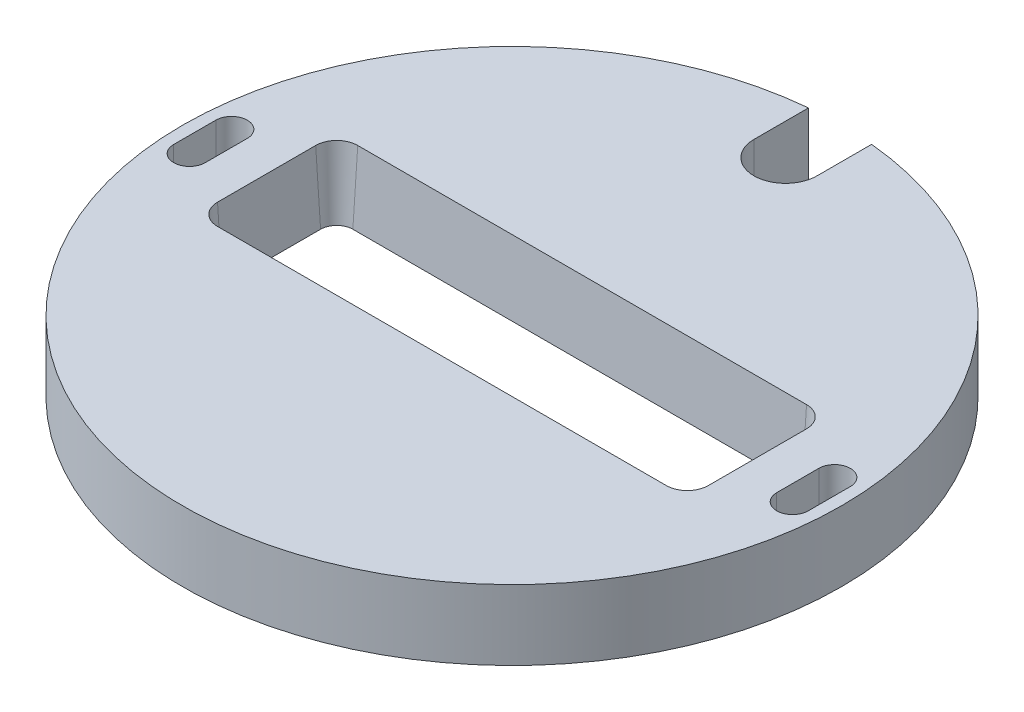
ISO-10303-21;
HEADER;
FILE_DESCRIPTION(('STEP AP214'),'2;1');
FILE_NAME('part.step','',(''),(''),'','','');
FILE_SCHEMA(('AUTOMOTIVE_DESIGN { 1 0 10303 214 1 1 1 1 }'));
ENDSEC;
DATA;
#1=APPLICATION_CONTEXT('core data for automotive mechanical design processes');
#2=APPLICATION_PROTOCOL_DEFINITION('international standard','automotive_design',2000,#1);
#3=PRODUCT_CONTEXT('',#1,'mechanical');
#4=PRODUCT('Part','Part','',(#3));
#5=PRODUCT_RELATED_PRODUCT_CATEGORY('part','',(#4));
#6=PRODUCT_DEFINITION_FORMATION('','',#4);
#7=PRODUCT_DEFINITION_CONTEXT('part definition',#1,'design');
#8=PRODUCT_DEFINITION('design','',#6,#7);
#9=PRODUCT_DEFINITION_SHAPE('','',#8);
#10=(LENGTH_UNIT() NAMED_UNIT(*) SI_UNIT(.MILLI.,.METRE.));
#11=(NAMED_UNIT(*) PLANE_ANGLE_UNIT() SI_UNIT($,.RADIAN.));
#12=(NAMED_UNIT(*) SI_UNIT($,.STERADIAN.) SOLID_ANGLE_UNIT());
#13=UNCERTAINTY_MEASURE_WITH_UNIT(LENGTH_MEASURE(1.E-05),#10,'distance_accuracy_value','');
#14=(GEOMETRIC_REPRESENTATION_CONTEXT(3) GLOBAL_UNCERTAINTY_ASSIGNED_CONTEXT((#13)) GLOBAL_UNIT_ASSIGNED_CONTEXT((#10,
#11,#12)) REPRESENTATION_CONTEXT('',''));
#15=CARTESIAN_POINT('',(0.,0.,0.));
#16=DIRECTION('',(0.,0.,1.));
#17=DIRECTION('',(1.,0.,0.));
#18=AXIS2_PLACEMENT_3D('',#15,#16,#17);
#19=CARTESIAN_POINT('',(0.,10.,0.));
#20=DIRECTION('',(0.,1.,0.));
#21=DIRECTION('',(0.,0.,1.));
#22=AXIS2_PLACEMENT_3D('',#19,#20,#21);
#23=PLANE('',#22);
#24=DIRECTION('',(0.,0.,1.));
#25=VECTOR('',#24,1.);
#26=CARTESIAN_POINT('',(4.5,10.,-39.));
#27=LINE('',#26,#25);
#28=CARTESIAN_POINT('',(4.5,10.,-39.));
#29=VERTEX_POINT('',#28);
#30=CARTESIAN_POINT('',(4.5,10.,-46.7840784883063));
#31=VERTEX_POINT('',#30);
#32=EDGE_CURVE('E239',#29,#31,#27,.F.);
#33=ORIENTED_EDGE('',*,*,#32,.F.);
#34=CARTESIAN_POINT('',(0.,10.,-39.));
#35=DIRECTION('',(0.,-1.,0.));
#36=DIRECTION('',(0.,0.,-1.));
#37=AXIS2_PLACEMENT_3D('',#34,#35,#36);
#38=CIRCLE('',#37,4.5);
#39=CARTESIAN_POINT('',(-4.5,10.,-39.));
#40=VERTEX_POINT('',#39);
#41=EDGE_CURVE('E234',#29,#40,#38,.T.);
#42=ORIENTED_EDGE('',*,*,#41,.T.);
#43=DIRECTION('',(0.,0.,1.));
#44=VECTOR('',#43,1.);
#45=CARTESIAN_POINT('',(-4.5,10.,-39.));
#46=LINE('',#45,#44);
#47=CARTESIAN_POINT('',(-4.5,10.,-46.7840784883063));
#48=VERTEX_POINT('',#47);
#49=EDGE_CURVE('E267',#40,#48,#46,.F.);
#50=ORIENTED_EDGE('',*,*,#49,.T.);
#51=CARTESIAN_POINT('',(0.,10.,0.));
#52=DIRECTION('',(0.,-1.,0.));
#53=DIRECTION('',(0.,0.,-1.));
#54=AXIS2_PLACEMENT_3D('',#51,#52,#53);
#55=CIRCLE('',#54,47.);
#56=EDGE_CURVE('E237',#31,#48,#55,.T.);
#57=ORIENTED_EDGE('',*,*,#56,.F.);
#58=EDGE_LOOP('',(#33,#42,#50,#57));
#59=FACE_BOUND('',#58,.T.);
#60=CARTESIAN_POINT('',(-43.,10.,3.));
#61=DIRECTION('',(0.,1.,0.));
#62=DIRECTION('',(0.,0.,1.));
#63=AXIS2_PLACEMENT_3D('',#60,#61,#62);
#64=CIRCLE('',#63,2.25);
#65=CARTESIAN_POINT('',(-40.75,10.,3.));
#66=VERTEX_POINT('',#65);
#67=CARTESIAN_POINT('',(-45.25,10.,3.));
#68=VERTEX_POINT('',#67);
#69=EDGE_CURVE('E245',#66,#68,#64,.F.);
#70=ORIENTED_EDGE('',*,*,#69,.T.);
#71=DIRECTION('',(0.,0.,1.));
#72=VECTOR('',#71,1.);
#73=CARTESIAN_POINT('',(-45.25,10.,-3.));
#74=LINE('',#73,#72);
#75=CARTESIAN_POINT('',(-45.25,10.,-3.));
#76=VERTEX_POINT('',#75);
#77=EDGE_CURVE('E275',#68,#76,#74,.F.);
#78=ORIENTED_EDGE('',*,*,#77,.T.);
#79=CARTESIAN_POINT('',(-43.,10.,-3.));
#80=DIRECTION('',(0.,1.,0.));
#81=DIRECTION('',(0.,0.,1.));
#82=AXIS2_PLACEMENT_3D('',#79,#80,#81);
#83=CIRCLE('',#82,2.25);
#84=CARTESIAN_POINT('',(-40.75,10.,-3.));
#85=VERTEX_POINT('',#84);
#86=EDGE_CURVE('E241',#76,#85,#83,.F.);
#87=ORIENTED_EDGE('',*,*,#86,.T.);
#88=DIRECTION('',(0.,0.,-1.));
#89=VECTOR('',#88,1.);
#90=CARTESIAN_POINT('',(-40.75,10.,-3.));
#91=LINE('',#90,#89);
#92=EDGE_CURVE('E240',#85,#66,#91,.F.);
#93=ORIENTED_EDGE('',*,*,#92,.T.);
#94=EDGE_LOOP('',(#70,#78,#87,#93));
#95=FACE_BOUND('',#94,.T.);
#96=DIRECTION('',(0.,0.,-1.));
#97=VECTOR('',#96,1.);
#98=CARTESIAN_POINT('',(45.25,10.,3.));
#99=LINE('',#98,#97);
#100=CARTESIAN_POINT('',(45.25,10.,-3.));
#101=VERTEX_POINT('',#100);
#102=CARTESIAN_POINT('',(45.25,10.,3.));
#103=VERTEX_POINT('',#102);
#104=EDGE_CURVE('E186',#101,#103,#99,.F.);
#105=ORIENTED_EDGE('',*,*,#104,.T.);
#106=CARTESIAN_POINT('',(43.,10.,3.));
#107=DIRECTION('',(0.,1.,0.));
#108=DIRECTION('',(0.,0.,1.));
#109=AXIS2_PLACEMENT_3D('',#106,#107,#108);
#110=CIRCLE('',#109,2.25);
#111=CARTESIAN_POINT('',(40.75,10.,3.));
#112=VERTEX_POINT('',#111);
#113=EDGE_CURVE('E249',#103,#112,#110,.F.);
#114=ORIENTED_EDGE('',*,*,#113,.T.);
#115=DIRECTION('',(0.,0.,1.));
#116=VECTOR('',#115,1.);
#117=CARTESIAN_POINT('',(40.75,10.,3.));
#118=LINE('',#117,#116);
#119=CARTESIAN_POINT('',(40.75,10.,-3.));
#120=VERTEX_POINT('',#119);
#121=EDGE_CURVE('E248',#112,#120,#118,.F.);
#122=ORIENTED_EDGE('',*,*,#121,.T.);
#123=CARTESIAN_POINT('',(43.,10.,-3.));
#124=DIRECTION('',(0.,1.,0.));
#125=DIRECTION('',(0.,0.,1.));
#126=AXIS2_PLACEMENT_3D('',#123,#124,#125);
#127=CIRCLE('',#126,2.25);
#128=EDGE_CURVE('E179',#120,#101,#127,.F.);
#129=ORIENTED_EDGE('',*,*,#128,.T.);
#130=EDGE_LOOP('',(#105,#114,#122,#129));
#131=FACE_BOUND('',#130,.T.);
#132=CARTESIAN_POINT('',(-32.,9.99999999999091,-7.));
#133=DIRECTION('',(0.,1.,0.));
#134=DIRECTION('',(0.,0.,1.));
#135=AXIS2_PLACEMENT_3D('',#132,#133,#134);
#136=CIRCLE('',#135,2.99999999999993);
#137=CARTESIAN_POINT('',(-35.000000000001,9.99999999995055,-6.99999999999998));
#138=VERTEX_POINT('',#137);
#139=CARTESIAN_POINT('',(-32.,9.99999999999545,-9.99999999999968));
#140=VERTEX_POINT('',#139);
#141=EDGE_CURVE('E254',#138,#140,#136,.F.);
#142=ORIENTED_EDGE('',*,*,#141,.T.);
#143=DIRECTION('',(1.,0.,0.));
#144=VECTOR('',#143,1.);
#145=CARTESIAN_POINT('',(-32.,10.,-10.));
#146=LINE('',#145,#144);
#147=CARTESIAN_POINT('',(32.,9.99999999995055,-9.999999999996));
#148=VERTEX_POINT('',#147);
#149=EDGE_CURVE('E188',#140,#148,#146,.T.);
#150=ORIENTED_EDGE('',*,*,#149,.T.);
#151=CARTESIAN_POINT('',(32.,9.99999999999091,-7.));
#152=DIRECTION('',(0.,1.,0.));
#153=DIRECTION('',(0.,0.,1.));
#154=AXIS2_PLACEMENT_3D('',#151,#152,#153);
#155=CIRCLE('',#154,2.99999999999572);
#156=CARTESIAN_POINT('',(34.9999999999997,9.99999999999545,-6.99999999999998));
#157=VERTEX_POINT('',#156);
#158=EDGE_CURVE('E176',#148,#157,#155,.F.);
#159=ORIENTED_EDGE('',*,*,#158,.T.);
#160=DIRECTION('',(0.,0.,1.));
#161=VECTOR('',#160,1.);
#162=CARTESIAN_POINT('',(35.,10.,-6.99999999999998));
#163=LINE('',#162,#161);
#164=CARTESIAN_POINT('',(34.9999999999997,9.99999999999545,6.99999999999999));
#165=VERTEX_POINT('',#164);
#166=EDGE_CURVE('E171',#157,#165,#163,.T.);
#167=ORIENTED_EDGE('',*,*,#166,.T.);
#168=CARTESIAN_POINT('',(32.,9.99999999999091,7.));
#169=DIRECTION('',(0.,1.,0.));
#170=DIRECTION('',(0.,0.,1.));
#171=AXIS2_PLACEMENT_3D('',#168,#169,#170);
#172=CIRCLE('',#171,2.99999999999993);
#173=CARTESIAN_POINT('',(32.,9.99999999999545,9.99999999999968));
#174=VERTEX_POINT('',#173);
#175=EDGE_CURVE('E27',#165,#174,#172,.F.);
#176=ORIENTED_EDGE('',*,*,#175,.T.);
#177=DIRECTION('',(1.,0.,0.));
#178=VECTOR('',#177,1.);
#179=CARTESIAN_POINT('',(-32.,10.,10.));
#180=LINE('',#179,#178);
#181=CARTESIAN_POINT('',(-32.,9.99999999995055,10.0000000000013));
#182=VERTEX_POINT('',#181);
#183=EDGE_CURVE('E196',#174,#182,#180,.F.);
#184=ORIENTED_EDGE('',*,*,#183,.T.);
#185=CARTESIAN_POINT('',(-32.,9.99999999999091,7.));
#186=DIRECTION('',(0.,1.,0.));
#187=DIRECTION('',(0.,0.,1.));
#188=AXIS2_PLACEMENT_3D('',#185,#186,#187);
#189=CIRCLE('',#188,2.99999999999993);
#190=CARTESIAN_POINT('',(-34.9999999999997,9.99999999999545,6.99999999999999));
#191=VERTEX_POINT('',#190);
#192=EDGE_CURVE('E255',#182,#191,#189,.F.);
#193=ORIENTED_EDGE('',*,*,#192,.T.);
#194=DIRECTION('',(0.,0.,1.));
#195=VECTOR('',#194,1.);
#196=CARTESIAN_POINT('',(-35.,10.,-6.99999999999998));
#197=LINE('',#196,#195);
#198=EDGE_CURVE('E192',#191,#138,#197,.F.);
#199=ORIENTED_EDGE('',*,*,#198,.T.);
#200=EDGE_LOOP('',(#142,#150,#159,#167,#176,#184,#193,#199));
#201=FACE_BOUND('',#200,.T.);
#202=ADVANCED_FACE('F24',(#59,#95,#131,#201),#23,.T.);
#203=CARTESIAN_POINT('',(32.,9.99999999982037,7.));
#204=DIRECTION('',(0.,1.,0.));
#205=DIRECTION('',(0.,0.,1.));
#206=AXIS2_PLACEMENT_3D('',#203,#204,#205);
#207=CONICAL_SURFACE('',#206,2.99999999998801,0.0698131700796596);
#208=DIRECTION('',(0.0697564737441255,0.997564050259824,0.));
#209=VECTOR('',#208,1.);
#210=CARTESIAN_POINT('',(35.,10.,6.99999999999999));
#211=LINE('',#210,#209);
#212=CARTESIAN_POINT('',(34.3007318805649,0.,6.99999999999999));
#213=VERTEX_POINT('',#212);
#214=EDGE_CURVE('E162',#165,#213,#211,.F.);
#215=ORIENTED_EDGE('',*,*,#214,.T.);
#216=CARTESIAN_POINT('',(32.,0.,7.));
#217=DIRECTION('',(0.,1.,0.));
#218=DIRECTION('',(0.,0.,1.));
#219=AXIS2_PLACEMENT_3D('',#216,#217,#218);
#220=CIRCLE('',#219,2.3007318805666);
#221=CARTESIAN_POINT('',(32.,0.,9.30073188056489));
#222=VERTEX_POINT('',#221);
#223=EDGE_CURVE('E231',#213,#222,#220,.F.);
#224=ORIENTED_EDGE('',*,*,#223,.T.);
#225=DIRECTION('',(0.,-0.997564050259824,-0.0697564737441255));
#226=VECTOR('',#225,1.);
#227=CARTESIAN_POINT('',(32.,10.,10.));
#228=LINE('',#227,#226);
#229=EDGE_CURVE('E164',#222,#174,#228,.F.);
#230=ORIENTED_EDGE('',*,*,#229,.T.);
#231=ORIENTED_EDGE('',*,*,#175,.F.);
#232=EDGE_LOOP('',(#215,#224,#230,#231));
#233=FACE_BOUND('',#232,.T.);
#234=ADVANCED_FACE('F160',(#233),#207,.F.);
#235=CARTESIAN_POINT('',(-32.,10.,10.));
#236=DIRECTION('',(0.,-0.0697564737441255,0.997564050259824));
#237=DIRECTION('',(0.,-0.997564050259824,-0.0697564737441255));
#238=AXIS2_PLACEMENT_3D('',#235,#236,#237);
#239=PLANE('',#238);
#240=ORIENTED_EDGE('',*,*,#229,.F.);
#241=DIRECTION('',(1.,0.,0.));
#242=VECTOR('',#241,1.);
#243=CARTESIAN_POINT('',(0.,0.,9.30073188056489));
#244=LINE('',#243,#242);
#245=CARTESIAN_POINT('',(-32.,1.4210854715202E-11,9.30073188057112));
#246=VERTEX_POINT('',#245);
#247=EDGE_CURVE('E230',#222,#246,#244,.F.);
#248=ORIENTED_EDGE('',*,*,#247,.T.);
#249=DIRECTION('',(0.,-0.997564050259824,-0.0697564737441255));
#250=VECTOR('',#249,1.);
#251=CARTESIAN_POINT('',(-31.9999999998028,499000.,34902.7798916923));
#252=LINE('',#251,#250);
#253=EDGE_CURVE('E198',#246,#182,#252,.F.);
#254=ORIENTED_EDGE('',*,*,#253,.T.);
#255=ORIENTED_EDGE('',*,*,#183,.F.);
#256=EDGE_LOOP('',(#240,#248,#254,#255));
#257=FACE_BOUND('',#256,.T.);
#258=ADVANCED_FACE('F529',(#257),#239,.F.);
#259=CARTESIAN_POINT('',(-32.,9.99999999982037,7.));
#260=DIRECTION('',(0.,1.,0.));
#261=DIRECTION('',(0.,0.,1.));
#262=AXIS2_PLACEMENT_3D('',#259,#260,#261);
#263=CONICAL_SURFACE('',#262,2.99999999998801,0.0698131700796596);
#264=ORIENTED_EDGE('',*,*,#253,.F.);
#265=CARTESIAN_POINT('',(-32.,0.,7.));
#266=DIRECTION('',(0.,1.,0.));
#267=DIRECTION('',(0.,0.,1.));
#268=AXIS2_PLACEMENT_3D('',#265,#266,#267);
#269=CIRCLE('',#268,2.3007318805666);
#270=CARTESIAN_POINT('',(-34.3007318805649,0.,7.));
#271=VERTEX_POINT('',#270);
#272=EDGE_CURVE('E227',#246,#271,#269,.F.);
#273=ORIENTED_EDGE('',*,*,#272,.T.);
#274=DIRECTION('',(0.0697564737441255,-0.997564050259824,0.));
#275=VECTOR('',#274,1.);
#276=CARTESIAN_POINT('',(-35.,10.,6.99999999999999));
#277=LINE('',#276,#275);
#278=EDGE_CURVE('E195',#271,#191,#277,.F.);
#279=ORIENTED_EDGE('',*,*,#278,.T.);
#280=ORIENTED_EDGE('',*,*,#192,.F.);
#281=EDGE_LOOP('',(#264,#273,#279,#280));
#282=FACE_BOUND('',#281,.T.);
#283=ADVANCED_FACE('F521',(#282),#263,.F.);
#284=CARTESIAN_POINT('',(-35.,10.,-6.99999999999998));
#285=DIRECTION('',(-0.997564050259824,-0.0697564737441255,0.));
#286=DIRECTION('',(0.0697564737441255,-0.997564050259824,0.));
#287=AXIS2_PLACEMENT_3D('',#284,#285,#286);
#288=PLANE('',#287);
#289=ORIENTED_EDGE('',*,*,#278,.F.);
#290=DIRECTION('',(0.,0.,1.));
#291=VECTOR('',#290,1.);
#292=CARTESIAN_POINT('',(-34.3007318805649,0.,0.));
#293=LINE('',#292,#291);
#294=CARTESIAN_POINT('',(-34.3007318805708,1.4210854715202E-11,-6.99999999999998));
#295=VERTEX_POINT('',#294);
#296=EDGE_CURVE('E226',#271,#295,#293,.F.);
#297=ORIENTED_EDGE('',*,*,#296,.T.);
#298=DIRECTION('',(0.0697564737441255,-0.997564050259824,0.));
#299=VECTOR('',#298,1.);
#300=CARTESIAN_POINT('',(-34927.7798916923,499000.,-6.99999999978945));
#301=LINE('',#300,#299);
#302=EDGE_CURVE('E194',#295,#138,#301,.F.);
#303=ORIENTED_EDGE('',*,*,#302,.T.);
#304=ORIENTED_EDGE('',*,*,#198,.F.);
#305=EDGE_LOOP('',(#289,#297,#303,#304));
#306=FACE_BOUND('',#305,.T.);
#307=ADVANCED_FACE('F299',(#306),#288,.F.);
#308=CARTESIAN_POINT('',(-32.,9.99999999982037,-7.));
#309=DIRECTION('',(0.,1.,0.));
#310=DIRECTION('',(0.,0.,1.));
#311=AXIS2_PLACEMENT_3D('',#308,#309,#310);
#312=CONICAL_SURFACE('',#311,2.99999999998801,0.0698131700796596);
#313=ORIENTED_EDGE('',*,*,#302,.F.);
#314=CARTESIAN_POINT('',(-32.,0.,-7.));
#315=DIRECTION('',(0.,1.,0.));
#316=DIRECTION('',(0.,0.,1.));
#317=AXIS2_PLACEMENT_3D('',#314,#315,#316);
#318=CIRCLE('',#317,2.3007318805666);
#319=CARTESIAN_POINT('',(-32.,0.,-9.30073188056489));
#320=VERTEX_POINT('',#319);
#321=EDGE_CURVE('E223',#295,#320,#318,.F.);
#322=ORIENTED_EDGE('',*,*,#321,.T.);
#323=DIRECTION('',(0.,0.997564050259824,-0.0697564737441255));
#324=VECTOR('',#323,1.);
#325=CARTESIAN_POINT('',(-32.,10.,-10.));
#326=LINE('',#325,#324);
#327=EDGE_CURVE('E191',#320,#140,#326,.T.);
#328=ORIENTED_EDGE('',*,*,#327,.T.);
#329=ORIENTED_EDGE('',*,*,#141,.F.);
#330=EDGE_LOOP('',(#313,#322,#328,#329));
#331=FACE_BOUND('',#330,.T.);
#332=ADVANCED_FACE('F304',(#331),#312,.F.);
#333=CARTESIAN_POINT('',(-32.,10.,-10.));
#334=DIRECTION('',(0.,-0.0697564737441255,-0.997564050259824));
#335=DIRECTION('',(0.,0.997564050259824,-0.0697564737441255));
#336=AXIS2_PLACEMENT_3D('',#333,#334,#335);
#337=PLANE('',#336);
#338=ORIENTED_EDGE('',*,*,#327,.F.);
#339=DIRECTION('',(1.,0.,0.));
#340=VECTOR('',#339,1.);
#341=CARTESIAN_POINT('',(0.,0.,-9.30073188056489));
#342=LINE('',#341,#340);
#343=CARTESIAN_POINT('',(32.,1.4210854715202E-11,-9.30073188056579));
#344=VERTEX_POINT('',#343);
#345=EDGE_CURVE('E222',#320,#344,#342,.T.);
#346=ORIENTED_EDGE('',*,*,#345,.T.);
#347=DIRECTION('',(0.,-0.997564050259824,0.0697564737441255));
#348=VECTOR('',#347,1.);
#349=CARTESIAN_POINT('',(32.,499000.,-34902.7798916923));
#350=LINE('',#349,#348);
#351=EDGE_CURVE('E190',#344,#148,#350,.F.);
#352=ORIENTED_EDGE('',*,*,#351,.T.);
#353=ORIENTED_EDGE('',*,*,#149,.F.);
#354=EDGE_LOOP('',(#338,#346,#352,#353));
#355=FACE_BOUND('',#354,.T.);
#356=ADVANCED_FACE('F498',(#355),#337,.F.);
#357=CARTESIAN_POINT('',(32.,9.99999999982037,-7.));
#358=DIRECTION('',(0.,1.,0.));
#359=DIRECTION('',(0.,0.,1.));
#360=AXIS2_PLACEMENT_3D('',#357,#358,#359);
#361=CONICAL_SURFACE('',#360,2.9999999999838,0.0698131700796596);
#362=ORIENTED_EDGE('',*,*,#351,.F.);
#363=CARTESIAN_POINT('',(32.,0.,-7.));
#364=DIRECTION('',(0.,1.,0.));
#365=DIRECTION('',(0.,0.,1.));
#366=AXIS2_PLACEMENT_3D('',#363,#364,#365);
#367=CIRCLE('',#366,2.3007318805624);
#368=CARTESIAN_POINT('',(34.3007318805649,0.,-6.99999999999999));
#369=VERTEX_POINT('',#368);
#370=EDGE_CURVE('E219',#344,#369,#367,.F.);
#371=ORIENTED_EDGE('',*,*,#370,.T.);
#372=DIRECTION('',(0.0697564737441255,0.997564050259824,0.));
#373=VECTOR('',#372,1.);
#374=CARTESIAN_POINT('',(35.,10.,-6.99999999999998));
#375=LINE('',#374,#373);
#376=EDGE_CURVE('E175',#369,#157,#375,.T.);
#377=ORIENTED_EDGE('',*,*,#376,.T.);
#378=ORIENTED_EDGE('',*,*,#158,.F.);
#379=EDGE_LOOP('',(#362,#371,#377,#378));
#380=FACE_BOUND('',#379,.T.);
#381=ADVANCED_FACE('F490',(#380),#361,.F.);
#382=CARTESIAN_POINT('',(35.,10.,-6.99999999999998));
#383=DIRECTION('',(0.997564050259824,-0.0697564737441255,0.));
#384=DIRECTION('',(0.0697564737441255,0.997564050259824,0.));
#385=AXIS2_PLACEMENT_3D('',#382,#383,#384);
#386=PLANE('',#385);
#387=ORIENTED_EDGE('',*,*,#376,.F.);
#388=DIRECTION('',(0.,0.,1.));
#389=VECTOR('',#388,1.);
#390=CARTESIAN_POINT('',(34.3007318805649,0.,0.));
#391=LINE('',#390,#389);
#392=EDGE_CURVE('E174',#369,#213,#391,.T.);
#393=ORIENTED_EDGE('',*,*,#392,.T.);
#394=ORIENTED_EDGE('',*,*,#214,.F.);
#395=ORIENTED_EDGE('',*,*,#166,.F.);
#396=EDGE_LOOP('',(#387,#393,#394,#395));
#397=FACE_BOUND('',#396,.T.);
#398=ADVANCED_FACE('F170',(#397),#386,.F.);
#399=CARTESIAN_POINT('',(43.,0.,-3.));
#400=DIRECTION('',(0.,1.,0.));
#401=DIRECTION('',(0.,0.,1.));
#402=AXIS2_PLACEMENT_3D('',#399,#400,#401);
#403=CYLINDRICAL_SURFACE('',#402,2.25);
#404=DIRECTION('',(0.,1.,0.));
#405=VECTOR('',#404,1.);
#406=CARTESIAN_POINT('',(40.75,0.,-3.));
#407=LINE('',#406,#405);
#408=CARTESIAN_POINT('',(40.75,0.,-3.));
#409=VERTEX_POINT('',#408);
#410=EDGE_CURVE('E250',#120,#409,#407,.F.);
#411=ORIENTED_EDGE('',*,*,#410,.T.);
#412=CARTESIAN_POINT('',(43.,0.,-3.));
#413=DIRECTION('',(0.,1.,0.));
#414=DIRECTION('',(0.,0.,1.));
#415=AXIS2_PLACEMENT_3D('',#412,#413,#414);
#416=CIRCLE('',#415,2.25);
#417=CARTESIAN_POINT('',(45.25,0.,-3.));
#418=VERTEX_POINT('',#417);
#419=EDGE_CURVE('E216',#409,#418,#416,.F.);
#420=ORIENTED_EDGE('',*,*,#419,.T.);
#421=DIRECTION('',(0.,1.,0.));
#422=VECTOR('',#421,1.);
#423=CARTESIAN_POINT('',(45.25,0.,-3.));
#424=LINE('',#423,#422);
#425=EDGE_CURVE('E181',#418,#101,#424,.T.);
#426=ORIENTED_EDGE('',*,*,#425,.T.);
#427=ORIENTED_EDGE('',*,*,#128,.F.);
#428=EDGE_LOOP('',(#411,#420,#426,#427));
#429=FACE_BOUND('',#428,.T.);
#430=ADVANCED_FACE('F358',(#429),#403,.F.);
#431=CARTESIAN_POINT('',(45.25,0.,3.));
#432=DIRECTION('',(1.,0.,0.));
#433=DIRECTION('',(0.,0.,-1.));
#434=AXIS2_PLACEMENT_3D('',#431,#432,#433);
#435=PLANE('',#434);
#436=ORIENTED_EDGE('',*,*,#425,.F.);
#437=DIRECTION('',(0.,0.,1.));
#438=VECTOR('',#437,1.);
#439=CARTESIAN_POINT('',(45.25,0.,0.));
#440=LINE('',#439,#438);
#441=CARTESIAN_POINT('',(45.25,0.,3.));
#442=VERTEX_POINT('',#441);
#443=EDGE_CURVE('E215',#418,#442,#440,.T.);
#444=ORIENTED_EDGE('',*,*,#443,.T.);
#445=DIRECTION('',(0.,1.,0.));
#446=VECTOR('',#445,1.);
#447=CARTESIAN_POINT('',(45.25,0.,3.));
#448=LINE('',#447,#446);
#449=EDGE_CURVE('E251',#442,#103,#448,.T.);
#450=ORIENTED_EDGE('',*,*,#449,.T.);
#451=ORIENTED_EDGE('',*,*,#104,.F.);
#452=EDGE_LOOP('',(#436,#444,#450,#451));
#453=FACE_BOUND('',#452,.T.);
#454=ADVANCED_FACE('F353',(#453),#435,.F.);
#455=CARTESIAN_POINT('',(43.,0.,3.));
#456=DIRECTION('',(0.,1.,0.));
#457=DIRECTION('',(0.,0.,1.));
#458=AXIS2_PLACEMENT_3D('',#455,#456,#457);
#459=CYLINDRICAL_SURFACE('',#458,2.25);
#460=CARTESIAN_POINT('',(43.,0.,3.));
#461=DIRECTION('',(0.,1.,0.));
#462=DIRECTION('',(0.,0.,1.));
#463=AXIS2_PLACEMENT_3D('',#460,#461,#462);
#464=CIRCLE('',#463,2.25);
#465=CARTESIAN_POINT('',(40.75,0.,3.));
#466=VERTEX_POINT('',#465);
#467=EDGE_CURVE('E213',#442,#466,#464,.F.);
#468=ORIENTED_EDGE('',*,*,#467,.T.);
#469=DIRECTION('',(0.,1.,0.));
#470=VECTOR('',#469,1.);
#471=CARTESIAN_POINT('',(40.75,0.,3.));
#472=LINE('',#471,#470);
#473=EDGE_CURVE('E277',#466,#112,#472,.T.);
#474=ORIENTED_EDGE('',*,*,#473,.T.);
#475=ORIENTED_EDGE('',*,*,#113,.F.);
#476=ORIENTED_EDGE('',*,*,#449,.F.);
#477=EDGE_LOOP('',(#468,#474,#475,#476));
#478=FACE_BOUND('',#477,.T.);
#479=ADVANCED_FACE('F364',(#478),#459,.F.);
#480=CARTESIAN_POINT('',(40.75,0.,3.));
#481=DIRECTION('',(-1.,0.,0.));
#482=DIRECTION('',(0.,0.,1.));
#483=AXIS2_PLACEMENT_3D('',#480,#481,#482);
#484=PLANE('',#483);
#485=ORIENTED_EDGE('',*,*,#473,.F.);
#486=DIRECTION('',(0.,0.,1.));
#487=VECTOR('',#486,1.);
#488=CARTESIAN_POINT('',(40.75,0.,0.));
#489=LINE('',#488,#487);
#490=EDGE_CURVE('E212',#466,#409,#489,.F.);
#491=ORIENTED_EDGE('',*,*,#490,.T.);
#492=ORIENTED_EDGE('',*,*,#410,.F.);
#493=ORIENTED_EDGE('',*,*,#121,.F.);
#494=EDGE_LOOP('',(#485,#491,#492,#493));
#495=FACE_BOUND('',#494,.T.);
#496=ADVANCED_FACE('F361',(#495),#484,.F.);
#497=CARTESIAN_POINT('',(-43.,0.,3.));
#498=DIRECTION('',(0.,1.,0.));
#499=DIRECTION('',(0.,0.,1.));
#500=AXIS2_PLACEMENT_3D('',#497,#498,#499);
#501=CYLINDRICAL_SURFACE('',#500,2.25);
#502=CARTESIAN_POINT('',(-43.,0.,3.));
#503=DIRECTION('',(0.,1.,0.));
#504=DIRECTION('',(0.,0.,1.));
#505=AXIS2_PLACEMENT_3D('',#502,#503,#504);
#506=CIRCLE('',#505,2.25);
#507=CARTESIAN_POINT('',(-40.75,0.,3.));
#508=VERTEX_POINT('',#507);
#509=CARTESIAN_POINT('',(-45.25,0.,3.));
#510=VERTEX_POINT('',#509);
#511=EDGE_CURVE('E210',#508,#510,#506,.F.);
#512=ORIENTED_EDGE('',*,*,#511,.T.);
#513=DIRECTION('',(0.,1.,0.));
#514=VECTOR('',#513,1.);
#515=CARTESIAN_POINT('',(-45.25,0.,3.));
#516=LINE('',#515,#514);
#517=EDGE_CURVE('E247',#510,#68,#516,.T.);
#518=ORIENTED_EDGE('',*,*,#517,.T.);
#519=ORIENTED_EDGE('',*,*,#69,.F.);
#520=DIRECTION('',(0.,1.,0.));
#521=VECTOR('',#520,1.);
#522=CARTESIAN_POINT('',(-40.75,0.,3.));
#523=LINE('',#522,#521);
#524=EDGE_CURVE('E243',#66,#508,#523,.F.);
#525=ORIENTED_EDGE('',*,*,#524,.T.);
#526=EDGE_LOOP('',(#512,#518,#519,#525));
#527=FACE_BOUND('',#526,.T.);
#528=ADVANCED_FACE('F363',(#527),#501,.F.);
#529=CARTESIAN_POINT('',(-45.25,0.,-3.));
#530=DIRECTION('',(-1.,0.,0.));
#531=DIRECTION('',(0.,0.,1.));
#532=AXIS2_PLACEMENT_3D('',#529,#530,#531);
#533=PLANE('',#532);
#534=ORIENTED_EDGE('',*,*,#517,.F.);
#535=DIRECTION('',(0.,0.,1.));
#536=VECTOR('',#535,1.);
#537=CARTESIAN_POINT('',(-45.25,0.,0.));
#538=LINE('',#537,#536);
#539=CARTESIAN_POINT('',(-45.25,0.,-3.));
#540=VERTEX_POINT('',#539);
#541=EDGE_CURVE('E209',#510,#540,#538,.F.);
#542=ORIENTED_EDGE('',*,*,#541,.T.);
#543=DIRECTION('',(0.,1.,0.));
#544=VECTOR('',#543,1.);
#545=CARTESIAN_POINT('',(-45.25,0.,-3.));
#546=LINE('',#545,#544);
#547=EDGE_CURVE('E244',#540,#76,#546,.T.);
#548=ORIENTED_EDGE('',*,*,#547,.T.);
#549=ORIENTED_EDGE('',*,*,#77,.F.);
#550=EDGE_LOOP('',(#534,#542,#548,#549));
#551=FACE_BOUND('',#550,.T.);
#552=ADVANCED_FACE('F332',(#551),#533,.F.);
#553=CARTESIAN_POINT('',(-43.,0.,-3.));
#554=DIRECTION('',(0.,1.,0.));
#555=DIRECTION('',(0.,0.,1.));
#556=AXIS2_PLACEMENT_3D('',#553,#554,#555);
#557=CYLINDRICAL_SURFACE('',#556,2.25);
#558=ORIENTED_EDGE('',*,*,#547,.F.);
#559=CARTESIAN_POINT('',(-43.,0.,-3.));
#560=DIRECTION('',(0.,1.,0.));
#561=DIRECTION('',(0.,0.,1.));
#562=AXIS2_PLACEMENT_3D('',#559,#560,#561);
#563=CIRCLE('',#562,2.25);
#564=CARTESIAN_POINT('',(-40.75,0.,-3.));
#565=VERTEX_POINT('',#564);
#566=EDGE_CURVE('E206',#540,#565,#563,.F.);
#567=ORIENTED_EDGE('',*,*,#566,.T.);
#568=DIRECTION('',(0.,1.,0.));
#569=VECTOR('',#568,1.);
#570=CARTESIAN_POINT('',(-40.75,0.,-3.));
#571=LINE('',#570,#569);
#572=EDGE_CURVE('E274',#565,#85,#571,.T.);
#573=ORIENTED_EDGE('',*,*,#572,.T.);
#574=ORIENTED_EDGE('',*,*,#86,.F.);
#575=EDGE_LOOP('',(#558,#567,#573,#574));
#576=FACE_BOUND('',#575,.T.);
#577=ADVANCED_FACE('F338',(#576),#557,.F.);
#578=CARTESIAN_POINT('',(-40.75,0.,-3.));
#579=DIRECTION('',(1.,0.,0.));
#580=DIRECTION('',(0.,0.,-1.));
#581=AXIS2_PLACEMENT_3D('',#578,#579,#580);
#582=PLANE('',#581);
#583=ORIENTED_EDGE('',*,*,#572,.F.);
#584=DIRECTION('',(0.,0.,1.));
#585=VECTOR('',#584,1.);
#586=CARTESIAN_POINT('',(-40.75,0.,0.));
#587=LINE('',#586,#585);
#588=EDGE_CURVE('E205',#565,#508,#587,.T.);
#589=ORIENTED_EDGE('',*,*,#588,.T.);
#590=ORIENTED_EDGE('',*,*,#524,.F.);
#591=ORIENTED_EDGE('',*,*,#92,.F.);
#592=EDGE_LOOP('',(#583,#589,#590,#591));
#593=FACE_BOUND('',#592,.T.);
#594=ADVANCED_FACE('F395',(#593),#582,.F.);
#595=CARTESIAN_POINT('',(0.,10.,0.));
#596=DIRECTION('',(0.,-1.,0.));
#597=DIRECTION('',(0.,0.,-1.));
#598=AXIS2_PLACEMENT_3D('',#595,#596,#597);
#599=CYLINDRICAL_SURFACE('',#598,47.);
#600=ORIENTED_EDGE('',*,*,#56,.T.);
#601=DIRECTION('',(0.,1.,0.));
#602=VECTOR('',#601,1.);
#603=CARTESIAN_POINT('',(-4.5,10.,-46.7840784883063));
#604=LINE('',#603,#602);
#605=CARTESIAN_POINT('',(-4.5,0.,-46.7840784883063));
#606=VERTEX_POINT('',#605);
#607=EDGE_CURVE('E233',#48,#606,#604,.F.);
#608=ORIENTED_EDGE('',*,*,#607,.T.);
#609=CARTESIAN_POINT('',(0.,0.,0.));
#610=DIRECTION('',(0.,-1.,0.));
#611=DIRECTION('',(0.,0.,-1.));
#612=AXIS2_PLACEMENT_3D('',#609,#610,#611);
#613=CIRCLE('',#612,47.);
#614=CARTESIAN_POINT('',(4.50000000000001,0.,-46.7840784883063));
#615=VERTEX_POINT('',#614);
#616=EDGE_CURVE('E202',#606,#615,#613,.F.);
#617=ORIENTED_EDGE('',*,*,#616,.T.);
#618=DIRECTION('',(0.,1.,0.));
#619=VECTOR('',#618,1.);
#620=CARTESIAN_POINT('',(4.5,10.,-46.7840784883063));
#621=LINE('',#620,#619);
#622=EDGE_CURVE('E271',#31,#615,#621,.F.);
#623=ORIENTED_EDGE('',*,*,#622,.F.);
#624=EDGE_LOOP('',(#600,#608,#617,#623));
#625=FACE_BOUND('',#624,.T.);
#626=ADVANCED_FACE('F391',(#625),#599,.T.);
#627=CARTESIAN_POINT('',(4.5,10.,-39.));
#628=DIRECTION('',(-1.,0.,0.));
#629=DIRECTION('',(0.,0.,1.));
#630=AXIS2_PLACEMENT_3D('',#627,#628,#629);
#631=PLANE('',#630);
#632=ORIENTED_EDGE('',*,*,#32,.T.);
#633=ORIENTED_EDGE('',*,*,#622,.T.);
#634=DIRECTION('',(0.,0.,1.));
#635=VECTOR('',#634,1.);
#636=CARTESIAN_POINT('',(4.50000000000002,0.,0.));
#637=LINE('',#636,#635);
#638=CARTESIAN_POINT('',(4.50000000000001,0.,-39.));
#639=VERTEX_POINT('',#638);
#640=EDGE_CURVE('E201',#615,#639,#637,.T.);
#641=ORIENTED_EDGE('',*,*,#640,.T.);
#642=DIRECTION('',(0.,-1.,0.));
#643=VECTOR('',#642,1.);
#644=CARTESIAN_POINT('',(4.5,10.,-39.));
#645=LINE('',#644,#643);
#646=EDGE_CURVE('E236',#639,#29,#645,.F.);
#647=ORIENTED_EDGE('',*,*,#646,.T.);
#648=EDGE_LOOP('',(#632,#633,#641,#647));
#649=FACE_BOUND('',#648,.T.);
#650=ADVANCED_FACE('F387',(#649),#631,.T.);
#651=CARTESIAN_POINT('',(0.,10.,-39.));
#652=DIRECTION('',(0.,-1.,0.));
#653=DIRECTION('',(0.,0.,-1.));
#654=AXIS2_PLACEMENT_3D('',#651,#652,#653);
#655=CYLINDRICAL_SURFACE('',#654,4.5);
#656=DIRECTION('',(0.,1.,0.));
#657=VECTOR('',#656,1.);
#658=CARTESIAN_POINT('',(-4.5,10.,-39.));
#659=LINE('',#658,#657);
#660=CARTESIAN_POINT('',(-4.5,0.,-39.));
#661=VERTEX_POINT('',#660);
#662=EDGE_CURVE('E41',#661,#40,#659,.T.);
#663=ORIENTED_EDGE('',*,*,#662,.T.);
#664=ORIENTED_EDGE('',*,*,#41,.F.);
#665=ORIENTED_EDGE('',*,*,#646,.F.);
#666=CARTESIAN_POINT('',(0.,0.,-39.));
#667=DIRECTION('',(0.,-1.,0.));
#668=DIRECTION('',(0.,0.,-1.));
#669=AXIS2_PLACEMENT_3D('',#666,#667,#668);
#670=CIRCLE('',#669,4.5);
#671=EDGE_CURVE('E33',#639,#661,#670,.T.);
#672=ORIENTED_EDGE('',*,*,#671,.T.);
#673=EDGE_LOOP('',(#663,#664,#665,#672));
#674=FACE_BOUND('',#673,.T.);
#675=ADVANCED_FACE('F381',(#674),#655,.F.);
#676=CARTESIAN_POINT('',(-4.5,10.,-39.));
#677=DIRECTION('',(-1.,0.,0.));
#678=DIRECTION('',(0.,0.,1.));
#679=AXIS2_PLACEMENT_3D('',#676,#677,#678);
#680=PLANE('',#679);
#681=ORIENTED_EDGE('',*,*,#607,.F.);
#682=ORIENTED_EDGE('',*,*,#49,.F.);
#683=ORIENTED_EDGE('',*,*,#662,.F.);
#684=DIRECTION('',(0.,0.,1.));
#685=VECTOR('',#684,1.);
#686=CARTESIAN_POINT('',(-4.5,0.,0.));
#687=LINE('',#686,#685);
#688=EDGE_CURVE('E13',#661,#606,#687,.F.);
#689=ORIENTED_EDGE('',*,*,#688,.T.);
#690=EDGE_LOOP('',(#681,#682,#683,#689));
#691=FACE_BOUND('',#690,.T.);
#692=ADVANCED_FACE('F375',(#691),#680,.F.);
#693=CARTESIAN_POINT('',(0.,0.,0.));
#694=DIRECTION('',(0.,1.,0.));
#695=DIRECTION('',(0.,0.,1.));
#696=AXIS2_PLACEMENT_3D('',#693,#694,#695);
#697=PLANE('',#696);
#698=ORIENTED_EDGE('',*,*,#671,.F.);
#699=ORIENTED_EDGE('',*,*,#640,.F.);
#700=ORIENTED_EDGE('',*,*,#616,.F.);
#701=ORIENTED_EDGE('',*,*,#688,.F.);
#702=EDGE_LOOP('',(#698,#699,#700,#701));
#703=FACE_BOUND('',#702,.T.);
#704=ORIENTED_EDGE('',*,*,#566,.F.);
#705=ORIENTED_EDGE('',*,*,#541,.F.);
#706=ORIENTED_EDGE('',*,*,#511,.F.);
#707=ORIENTED_EDGE('',*,*,#588,.F.);
#708=EDGE_LOOP('',(#704,#705,#706,#707));
#709=FACE_BOUND('',#708,.T.);
#710=ORIENTED_EDGE('',*,*,#490,.F.);
#711=ORIENTED_EDGE('',*,*,#467,.F.);
#712=ORIENTED_EDGE('',*,*,#443,.F.);
#713=ORIENTED_EDGE('',*,*,#419,.F.);
#714=EDGE_LOOP('',(#710,#711,#712,#713));
#715=FACE_BOUND('',#714,.T.);
#716=ORIENTED_EDGE('',*,*,#370,.F.);
#717=ORIENTED_EDGE('',*,*,#345,.F.);
#718=ORIENTED_EDGE('',*,*,#321,.F.);
#719=ORIENTED_EDGE('',*,*,#296,.F.);
#720=ORIENTED_EDGE('',*,*,#272,.F.);
#721=ORIENTED_EDGE('',*,*,#247,.F.);
#722=ORIENTED_EDGE('',*,*,#223,.F.);
#723=ORIENTED_EDGE('',*,*,#392,.F.);
#724=EDGE_LOOP('',(#716,#717,#718,#719,#720,#721,#722,#723));
#725=FACE_BOUND('',#724,.T.);
#726=ADVANCED_FACE('F308',(#703,#709,#715,#725),#697,.F.);
#727=CLOSED_SHELL('',(#202,#234,#258,#283,#307,#332,#356,#381,#398,#430,#454,#479,#496,#528,
#552,#577,#594,#626,#650,#675,#692,#726));
#728=MANIFOLD_SOLID_BREP('B1',#727);
#729=ADVANCED_BREP_SHAPE_REPRESENTATION('',(#18,#728),#14);
#730=SHAPE_DEFINITION_REPRESENTATION(#9,#729);
ENDSEC;
END-ISO-10303-21;
